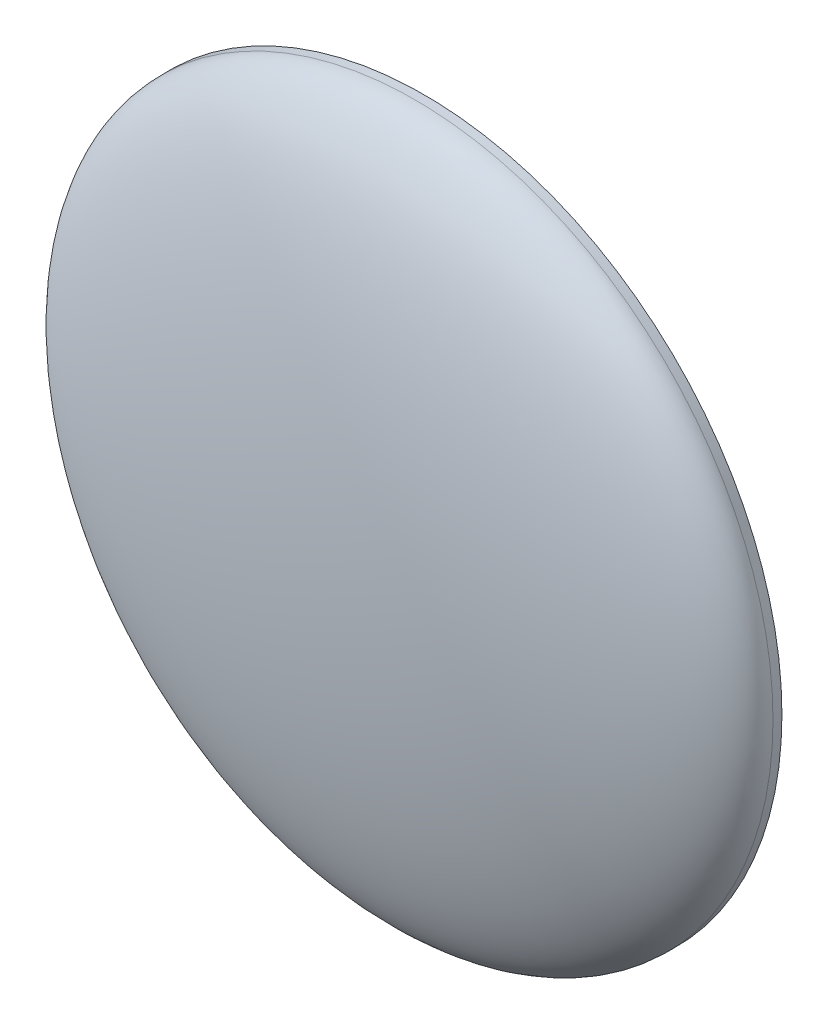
from build123d import *

# Parameters (mm, degrees)
ESQUISSE1_R       = 4
EXTRUSION1_DEPTH  = 0.1
D_ME1_FACE_RADIUS = 4
D_ME1_HEIGHT      = 1


with BuildPart() as part:
    # Esquisse1 → Extrusion1 (new body)
    with BuildSketch(Plane.XY):
        Circle(ESQUISSE1_R)
    extrude(amount=EXTRUSION1_DEPTH)

    # D_me1: an elliptical dome of height H over a round flat face of radius A is half a spheroid: the quarter ellipse of half axes A and H revolved about the face's axis
    with BuildSketch(Plane((0, 0, 0.1), x_dir=(0, 1, 0), z_dir=(1, 0, 0)), mode=Mode.PRIVATE) as d_me1_quarter:
        Ellipse(D_ME1_FACE_RADIUS, D_ME1_HEIGHT)
        Rectangle(D_ME1_FACE_RADIUS, D_ME1_HEIGHT, align=(Align.MIN, Align.MIN), mode=Mode.INTERSECT)
    revolve(d_me1_quarter.sketch, axis=Axis((0, 0, 0.1), (0, 0, 1)))


solid = part.part
